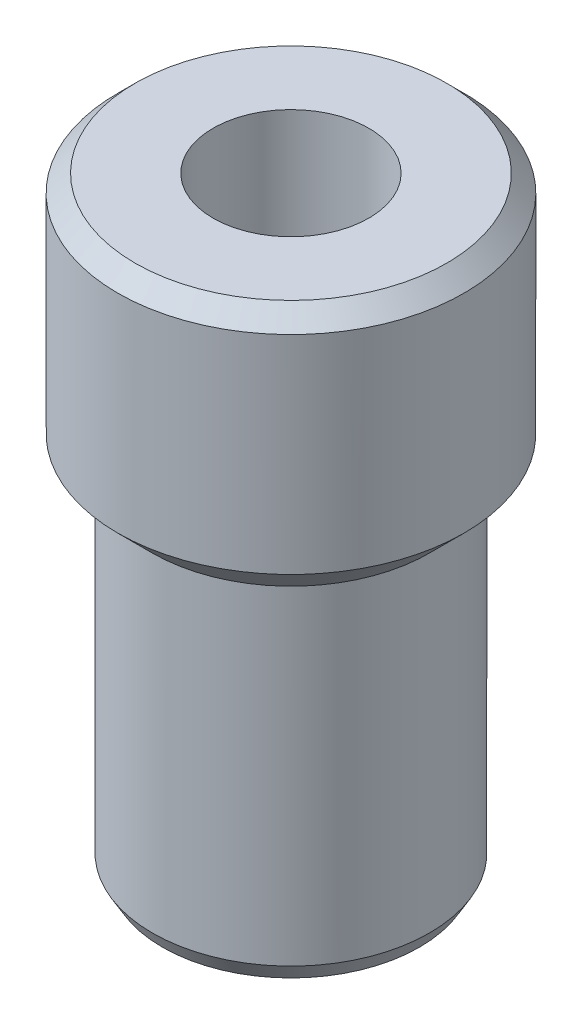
ISO-10303-21;
HEADER;
FILE_DESCRIPTION(('STEP AP214'),'2;1');
FILE_NAME('part.step','',(''),(''),'','','');
FILE_SCHEMA(('AUTOMOTIVE_DESIGN { 1 0 10303 214 1 1 1 1 }'));
ENDSEC;
DATA;
#1=APPLICATION_CONTEXT('core data for automotive mechanical design processes');
#2=APPLICATION_PROTOCOL_DEFINITION('international standard','automotive_design',2000,#1);
#3=PRODUCT_CONTEXT('',#1,'mechanical');
#4=PRODUCT('Part','Part','',(#3));
#5=PRODUCT_RELATED_PRODUCT_CATEGORY('part','',(#4));
#6=PRODUCT_DEFINITION_FORMATION('','',#4);
#7=PRODUCT_DEFINITION_CONTEXT('part definition',#1,'design');
#8=PRODUCT_DEFINITION('design','',#6,#7);
#9=PRODUCT_DEFINITION_SHAPE('','',#8);
#10=(LENGTH_UNIT() NAMED_UNIT(*) SI_UNIT(.MILLI.,.METRE.));
#11=(NAMED_UNIT(*) PLANE_ANGLE_UNIT() SI_UNIT($,.RADIAN.));
#12=(NAMED_UNIT(*) SI_UNIT($,.STERADIAN.) SOLID_ANGLE_UNIT());
#13=UNCERTAINTY_MEASURE_WITH_UNIT(LENGTH_MEASURE(1.E-05),#10,'distance_accuracy_value','');
#14=(GEOMETRIC_REPRESENTATION_CONTEXT(3) GLOBAL_UNCERTAINTY_ASSIGNED_CONTEXT((#13)) GLOBAL_UNIT_ASSIGNED_CONTEXT((#10,
#11,#12)) REPRESENTATION_CONTEXT('',''));
#15=CARTESIAN_POINT('',(0.,0.,0.));
#16=DIRECTION('',(0.,0.,1.));
#17=DIRECTION('',(1.,0.,0.));
#18=AXIS2_PLACEMENT_3D('',#15,#16,#17);
#19=CARTESIAN_POINT('',(0.,25.7125,0.));
#20=DIRECTION('',(0.,1.,0.));
#21=DIRECTION('',(0.,0.,1.));
#22=AXIS2_PLACEMENT_3D('',#19,#20,#21);
#23=CYLINDRICAL_SURFACE('',#22,4.49999999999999);
#24=CARTESIAN_POINT('',(0.,15.,0.));
#25=DIRECTION('',(0.,1.,0.));
#26=DIRECTION('',(0.,0.,1.));
#27=AXIS2_PLACEMENT_3D('',#24,#25,#26);
#28=CIRCLE('',#27,4.49999999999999);
#29=CARTESIAN_POINT('',(0.,15.,4.49999999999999));
#30=VERTEX_POINT('',#29);
#31=EDGE_CURVE('E54',#30,#30,#28,.T.);
#32=ORIENTED_EDGE('',*,*,#31,.T.);
#33=EDGE_LOOP('',(#32));
#34=FACE_BOUND('',#33,.T.);
#35=CARTESIAN_POINT('',(0.,-20.,0.));
#36=DIRECTION('',(0.,1.,0.));
#37=DIRECTION('',(0.,0.,1.));
#38=AXIS2_PLACEMENT_3D('',#35,#36,#37);
#39=CIRCLE('',#38,4.49999999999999);
#40=CARTESIAN_POINT('',(0.,-20.,4.49999999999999));
#41=VERTEX_POINT('',#40);
#42=EDGE_CURVE('E48',#41,#41,#39,.T.);
#43=ORIENTED_EDGE('',*,*,#42,.F.);
#44=EDGE_LOOP('',(#43));
#45=FACE_BOUND('',#44,.T.);
#46=ADVANCED_FACE('F26',(#34,#45),#23,.F.);
#47=CARTESIAN_POINT('',(7.99999999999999,-20.,0.));
#48=DIRECTION('',(0.,-1.,0.));
#49=DIRECTION('',(0.,0.,-1.));
#50=AXIS2_PLACEMENT_3D('',#47,#48,#49);
#51=PLANE('',#50);
#52=CARTESIAN_POINT('',(0.,-20.,0.));
#53=DIRECTION('',(0.,-1.,0.));
#54=DIRECTION('',(0.,0.,-1.));
#55=AXIS2_PLACEMENT_3D('',#52,#53,#54);
#56=CIRCLE('',#55,7.42264973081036);
#57=CARTESIAN_POINT('',(0.,-20.,-7.42264973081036));
#58=VERTEX_POINT('',#57);
#59=EDGE_CURVE('E32',#58,#58,#56,.T.);
#60=ORIENTED_EDGE('',*,*,#59,.T.);
#61=EDGE_LOOP('',(#60));
#62=FACE_BOUND('',#61,.T.);
#63=ORIENTED_EDGE('',*,*,#42,.T.);
#64=EDGE_LOOP('',(#63));
#65=FACE_BOUND('',#64,.T.);
#66=ADVANCED_FACE('F76',(#62,#65),#51,.T.);
#67=CARTESIAN_POINT('',(0.,25.7125,0.));
#68=DIRECTION('',(0.,1.,0.));
#69=DIRECTION('',(0.,0.,1.));
#70=AXIS2_PLACEMENT_3D('',#67,#68,#69);
#71=CYLINDRICAL_SURFACE('',#70,8.);
#72=CARTESIAN_POINT('',(0.,-19.,0.));
#73=DIRECTION('',(0.,-1.,0.));
#74=DIRECTION('',(0.,0.,-1.));
#75=AXIS2_PLACEMENT_3D('',#72,#73,#74);
#76=CIRCLE('',#75,8.);
#77=CARTESIAN_POINT('',(0.,-19.,-8.));
#78=VERTEX_POINT('',#77);
#79=EDGE_CURVE('E36',#78,#78,#76,.F.);
#80=ORIENTED_EDGE('',*,*,#79,.T.);
#81=EDGE_LOOP('',(#80));
#82=FACE_BOUND('',#81,.T.);
#83=CARTESIAN_POINT('',(0.,0.,0.));
#84=DIRECTION('',(0.,1.,0.));
#85=DIRECTION('',(0.,0.,1.));
#86=AXIS2_PLACEMENT_3D('',#83,#84,#85);
#87=CIRCLE('',#86,8.);
#88=CARTESIAN_POINT('',(0.,0.,8.));
#89=VERTEX_POINT('',#88);
#90=EDGE_CURVE('E51',#89,#89,#87,.T.);
#91=ORIENTED_EDGE('',*,*,#90,.F.);
#92=EDGE_LOOP('',(#91));
#93=FACE_BOUND('',#92,.T.);
#94=ADVANCED_FACE('F73',(#82,#93),#71,.T.);
#95=CARTESIAN_POINT('',(0.,25.7125,0.));
#96=DIRECTION('',(0.,1.,0.));
#97=DIRECTION('',(0.,0.,1.));
#98=AXIS2_PLACEMENT_3D('',#95,#96,#97);
#99=CYLINDRICAL_SURFACE('',#98,10.);
#100=CARTESIAN_POINT('',(0.,2.00000000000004,0.));
#101=DIRECTION('',(0.,-1.,0.));
#102=DIRECTION('',(0.,0.,-1.));
#103=AXIS2_PLACEMENT_3D('',#100,#101,#102);
#104=CIRCLE('',#103,10.);
#105=CARTESIAN_POINT('',(0.,2.00000000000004,-10.));
#106=VERTEX_POINT('',#105);
#107=EDGE_CURVE('E10',#106,#106,#104,.F.);
#108=ORIENTED_EDGE('',*,*,#107,.T.);
#109=EDGE_LOOP('',(#108));
#110=FACE_BOUND('',#109,.T.);
#111=CARTESIAN_POINT('',(0.,14.,0.));
#112=DIRECTION('',(0.,1.,0.));
#113=DIRECTION('',(0.,0.,1.));
#114=AXIS2_PLACEMENT_3D('',#111,#112,#113);
#115=CIRCLE('',#114,10.);
#116=CARTESIAN_POINT('',(0.,14.,10.));
#117=VERTEX_POINT('',#116);
#118=EDGE_CURVE('E40',#117,#117,#115,.F.);
#119=ORIENTED_EDGE('',*,*,#118,.T.);
#120=EDGE_LOOP('',(#119));
#121=FACE_BOUND('',#120,.T.);
#122=ADVANCED_FACE('F63',(#110,#121),#99,.T.);
#123=CARTESIAN_POINT('',(4.49999999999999,15.,0.));
#124=DIRECTION('',(0.,1.,0.));
#125=DIRECTION('',(0.,0.,1.));
#126=AXIS2_PLACEMENT_3D('',#123,#124,#125);
#127=PLANE('',#126);
#128=CARTESIAN_POINT('',(0.,15.,0.));
#129=DIRECTION('',(0.,1.,0.));
#130=DIRECTION('',(0.,0.,1.));
#131=AXIS2_PLACEMENT_3D('',#128,#129,#130);
#132=CIRCLE('',#131,8.99999999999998);
#133=CARTESIAN_POINT('',(0.,15.,8.99999999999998));
#134=VERTEX_POINT('',#133);
#135=EDGE_CURVE('E45',#134,#134,#132,.T.);
#136=ORIENTED_EDGE('',*,*,#135,.T.);
#137=EDGE_LOOP('',(#136));
#138=FACE_BOUND('',#137,.T.);
#139=ORIENTED_EDGE('',*,*,#31,.F.);
#140=EDGE_LOOP('',(#139));
#141=FACE_BOUND('',#140,.T.);
#142=ADVANCED_FACE('F60',(#138,#141),#127,.T.);
#143=CARTESIAN_POINT('',(0.,15.,0.));
#144=DIRECTION('',(0.,-1.,0.));
#145=DIRECTION('',(0.,0.,-1.));
#146=AXIS2_PLACEMENT_3D('',#143,#144,#145);
#147=CONICAL_SURFACE('',#146,8.99999999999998,0.785398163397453);
#148=ORIENTED_EDGE('',*,*,#118,.F.);
#149=EDGE_LOOP('',(#148));
#150=FACE_BOUND('',#149,.T.);
#151=ORIENTED_EDGE('',*,*,#135,.F.);
#152=EDGE_LOOP('',(#151));
#153=FACE_BOUND('',#152,.T.);
#154=ADVANCED_FACE('F62',(#150,#153),#147,.T.);
#155=CARTESIAN_POINT('',(0.,-19.,0.));
#156=DIRECTION('',(0.,1.,0.));
#157=DIRECTION('',(0.,0.,1.));
#158=AXIS2_PLACEMENT_3D('',#155,#156,#157);
#159=CONICAL_SURFACE('',#158,8.,0.523598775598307);
#160=ORIENTED_EDGE('',*,*,#59,.F.);
#161=EDGE_LOOP('',(#160));
#162=FACE_BOUND('',#161,.T.);
#163=ORIENTED_EDGE('',*,*,#79,.F.);
#164=EDGE_LOOP('',(#163));
#165=FACE_BOUND('',#164,.T.);
#166=ADVANCED_FACE('F70',(#162,#165),#159,.T.);
#167=CARTESIAN_POINT('',(0.,2.00000000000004,0.));
#168=DIRECTION('',(0.,1.,0.));
#169=DIRECTION('',(0.,0.,1.));
#170=AXIS2_PLACEMENT_3D('',#167,#168,#169);
#171=CONICAL_SURFACE('',#170,10.,0.785398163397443);
#172=ORIENTED_EDGE('',*,*,#90,.T.);
#173=EDGE_LOOP('',(#172));
#174=FACE_BOUND('',#173,.T.);
#175=ORIENTED_EDGE('',*,*,#107,.F.);
#176=EDGE_LOOP('',(#175));
#177=FACE_BOUND('',#176,.T.);
#178=ADVANCED_FACE('F93',(#174,#177),#171,.T.);
#179=CLOSED_SHELL('',(#46,#66,#94,#122,#142,#154,#166,#178));
#180=MANIFOLD_SOLID_BREP('B2',#179);
#181=ADVANCED_BREP_SHAPE_REPRESENTATION('',(#18,#180),#14);
#182=SHAPE_DEFINITION_REPRESENTATION(#9,#181);
ENDSEC;
END-ISO-10303-21;
